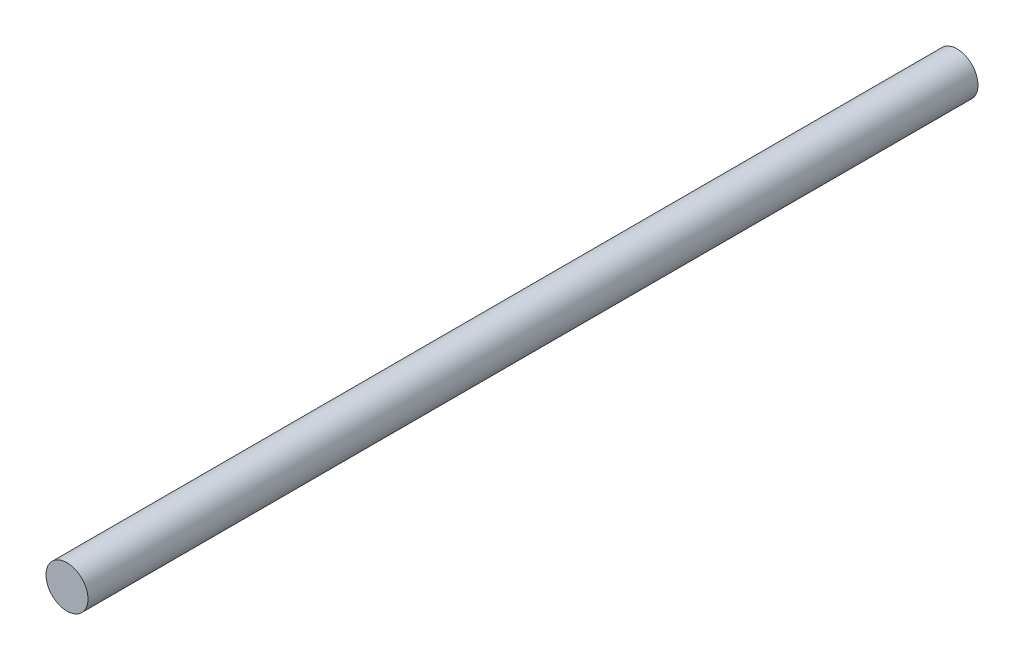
ISO-10303-21;
HEADER;
FILE_DESCRIPTION(('STEP AP214'),'2;1');
FILE_NAME('part.step','',(''),(''),'','','');
FILE_SCHEMA(('AUTOMOTIVE_DESIGN { 1 0 10303 214 1 1 1 1 }'));
ENDSEC;
DATA;
#1=APPLICATION_CONTEXT('core data for automotive mechanical design processes');
#2=APPLICATION_PROTOCOL_DEFINITION('international standard','automotive_design',2000,#1);
#3=PRODUCT_CONTEXT('',#1,'mechanical');
#4=PRODUCT('Part','Part','',(#3));
#5=PRODUCT_RELATED_PRODUCT_CATEGORY('part','',(#4));
#6=PRODUCT_DEFINITION_FORMATION('','',#4);
#7=PRODUCT_DEFINITION_CONTEXT('part definition',#1,'design');
#8=PRODUCT_DEFINITION('design','',#6,#7);
#9=PRODUCT_DEFINITION_SHAPE('','',#8);
#10=(LENGTH_UNIT() NAMED_UNIT(*) SI_UNIT(.MILLI.,.METRE.));
#11=(NAMED_UNIT(*) PLANE_ANGLE_UNIT() SI_UNIT($,.RADIAN.));
#12=(NAMED_UNIT(*) SI_UNIT($,.STERADIAN.) SOLID_ANGLE_UNIT());
#13=UNCERTAINTY_MEASURE_WITH_UNIT(LENGTH_MEASURE(1.E-05),#10,'distance_accuracy_value','');
#14=(GEOMETRIC_REPRESENTATION_CONTEXT(3) GLOBAL_UNCERTAINTY_ASSIGNED_CONTEXT((#13)) GLOBAL_UNIT_ASSIGNED_CONTEXT((#10,
#11,#12)) REPRESENTATION_CONTEXT('',''));
#15=CARTESIAN_POINT('',(0.,0.,0.));
#16=DIRECTION('',(0.,0.,1.));
#17=DIRECTION('',(1.,0.,0.));
#18=AXIS2_PLACEMENT_3D('',#15,#16,#17);
#19=CARTESIAN_POINT('',(0.,0.,46.6457530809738));
#20=DIRECTION('',(0.,0.,1.));
#21=DIRECTION('',(1.,0.,0.));
#22=AXIS2_PLACEMENT_3D('',#19,#20,#21);
#23=PLANE('',#22);
#24=CARTESIAN_POINT('',(0.,0.,46.6457530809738));
#25=DIRECTION('',(0.,0.,-1.));
#26=DIRECTION('',(-1.,0.,0.));
#27=AXIS2_PLACEMENT_3D('',#24,#25,#26);
#28=CIRCLE('',#27,2.2);
#29=CARTESIAN_POINT('',(-2.2,0.,46.6457530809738));
#30=VERTEX_POINT('',#29);
#31=EDGE_CURVE('E10',#30,#30,#28,.T.);
#32=ORIENTED_EDGE('',*,*,#31,.F.);
#33=EDGE_LOOP('',(#32));
#34=FACE_BOUND('',#33,.T.);
#35=ADVANCED_FACE('F15',(#34),#23,.T.);
#36=CARTESIAN_POINT('',(0.,0.,-46.6457530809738));
#37=DIRECTION('',(0.,0.,-1.));
#38=DIRECTION('',(-1.,0.,0.));
#39=AXIS2_PLACEMENT_3D('',#36,#37,#38);
#40=PLANE('',#39);
#41=CARTESIAN_POINT('',(0.,0.,-46.6457530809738));
#42=DIRECTION('',(0.,0.,1.));
#43=DIRECTION('',(1.,0.,0.));
#44=AXIS2_PLACEMENT_3D('',#41,#42,#43);
#45=CIRCLE('',#44,2.2);
#46=CARTESIAN_POINT('',(2.2,0.,-46.6457530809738));
#47=VERTEX_POINT('',#46);
#48=EDGE_CURVE('E22',#47,#47,#45,.T.);
#49=ORIENTED_EDGE('',*,*,#48,.F.);
#50=EDGE_LOOP('',(#49));
#51=FACE_BOUND('',#50,.T.);
#52=ADVANCED_FACE('F26',(#51),#40,.T.);
#53=CARTESIAN_POINT('',(0.,0.,-46.6457530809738));
#54=DIRECTION('',(0.,0.,1.));
#55=DIRECTION('',(1.,0.,0.));
#56=AXIS2_PLACEMENT_3D('',#53,#54,#55);
#57=CYLINDRICAL_SURFACE('',#56,2.2);
#58=ORIENTED_EDGE('',*,*,#31,.T.);
#59=EDGE_LOOP('',(#58));
#60=FACE_BOUND('',#59,.T.);
#61=ORIENTED_EDGE('',*,*,#48,.T.);
#62=EDGE_LOOP('',(#61));
#63=FACE_BOUND('',#62,.T.);
#64=ADVANCED_FACE('F17',(#60,#63),#57,.T.);
#65=CLOSED_SHELL('',(#35,#52,#64));
#66=MANIFOLD_SOLID_BREP('B1',#65);
#67=ADVANCED_BREP_SHAPE_REPRESENTATION('',(#18,#66),#14);
#68=SHAPE_DEFINITION_REPRESENTATION(#9,#67);
ENDSEC;
END-ISO-10303-21;
